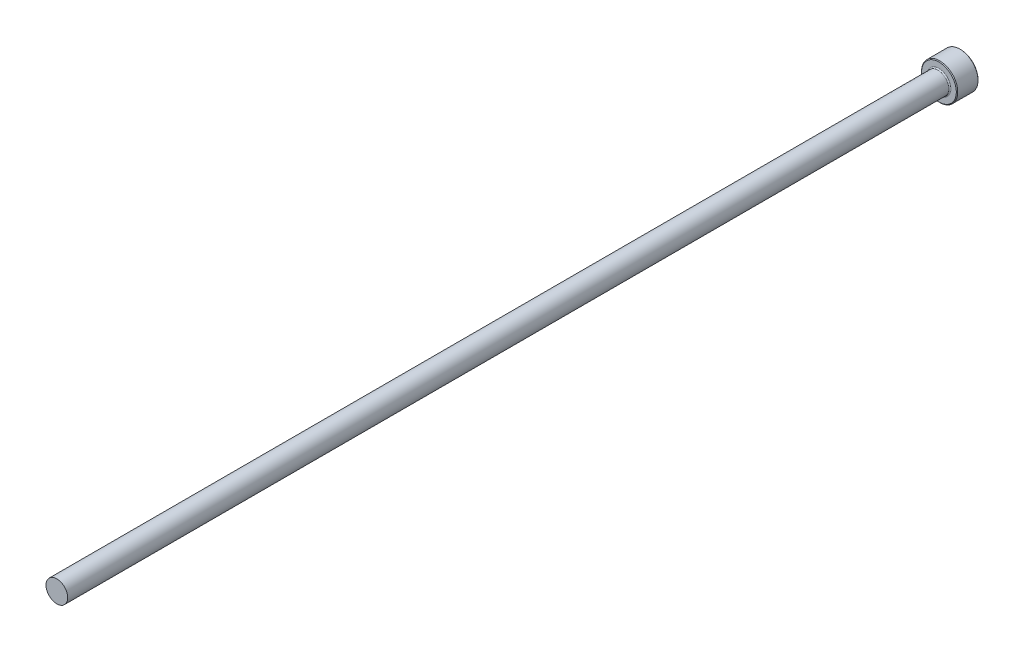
from build123d import *

# Parameters (mm, degrees)
CHAMFER1_SIZE = 0.2


with BuildPart() as part:
    # Sketch1 → Revolve1 (revolve)
    with BuildSketch(Plane(origin=(0, 0, 0), x_dir=(0, 0, -1), z_dir=(1, 0, 0)), mode=Mode.PRIVATE) as revolve1_sk:
        with BuildLine():
            Line((0, 0), (0, 5))
            Line((0, 5), (-6, 5))
            Line((-6, 5), (-6, 3.3))
            ThreePointArc((-6, 3.3), (-6.087867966, 3.087867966), (-6.3, 3))
            Line((-6.3, 3), (-250, 3))
            Line((-250, 3), (-250, 0))
            Line((-250, 0), (0, 0))
        make_face()
    revolve(revolve1_sk.sketch.rotate(Axis((0, 0, 109.05062828), (0, 0, -1)), 90), axis=Axis((0, 0, 109.05062828), (0, 0, -1)))

    # Chamfer1
    chamfer1_edges = [part.edges().sort_by_distance(p)[0] for p in [
        (-5, 0, 0),
        (-5, 0, 6),
    ]]
    chamfer(chamfer1_edges, length=CHAMFER1_SIZE)


solid = part.part
